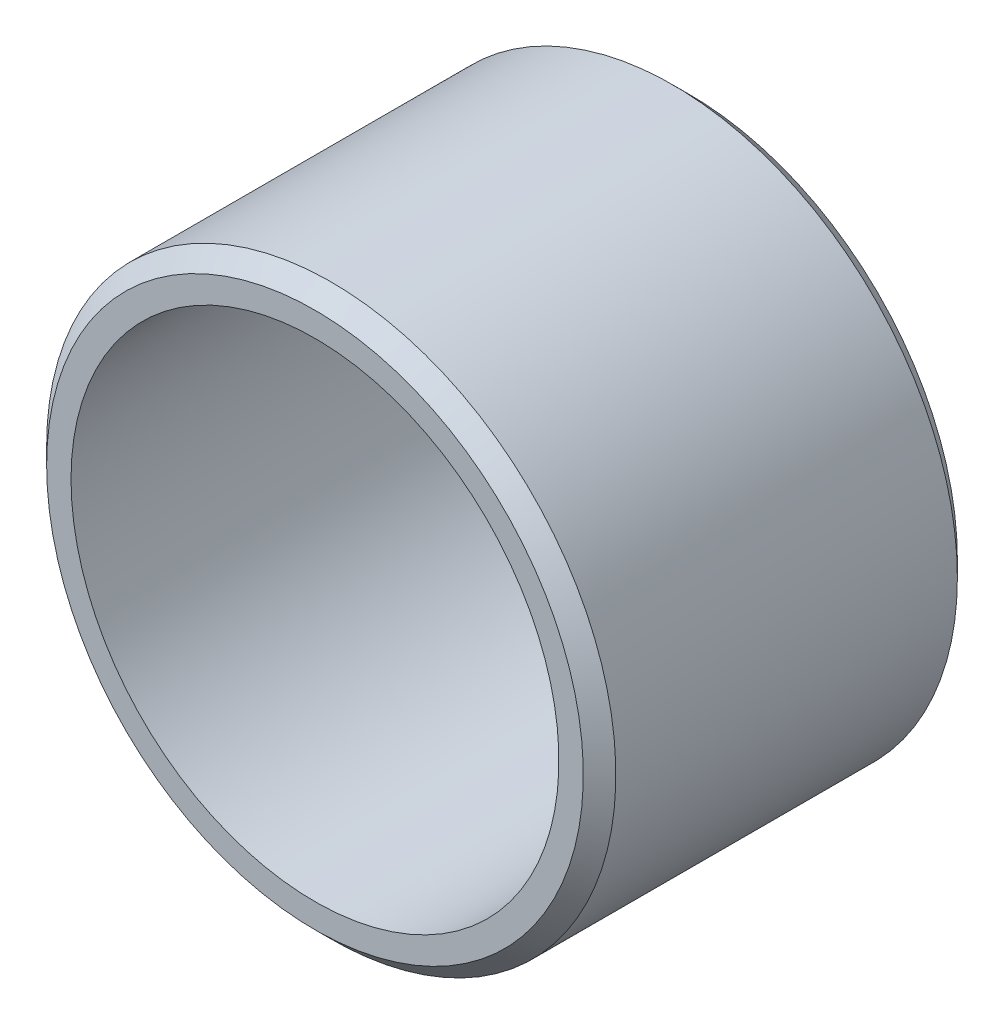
from build123d import *

# Parameters (mm, degrees)
ESQUISSE1_R      = 17.5
ESQUISSE1_R_2    = 15
EXTRUSION1_DEPTH = 23
CHANFREIN1_SIZE  = 1


with BuildPart() as part:
    # Esquisse1 → Extrusion1 (new body)
    with BuildSketch(Plane.XY):
        Circle(ESQUISSE1_R)
        Circle(ESQUISSE1_R_2, mode=Mode.SUBTRACT)
    extrude(amount=EXTRUSION1_DEPTH)

    # Chanfrein1
    chanfrein1_edges = [part.edges().sort_by_distance(p)[0] for p in [
        (-17.5, 0, 0),
        (-17.5, 0, 23),
    ]]
    chamfer(chanfrein1_edges, length=CHANFREIN1_SIZE)


solid = part.part
